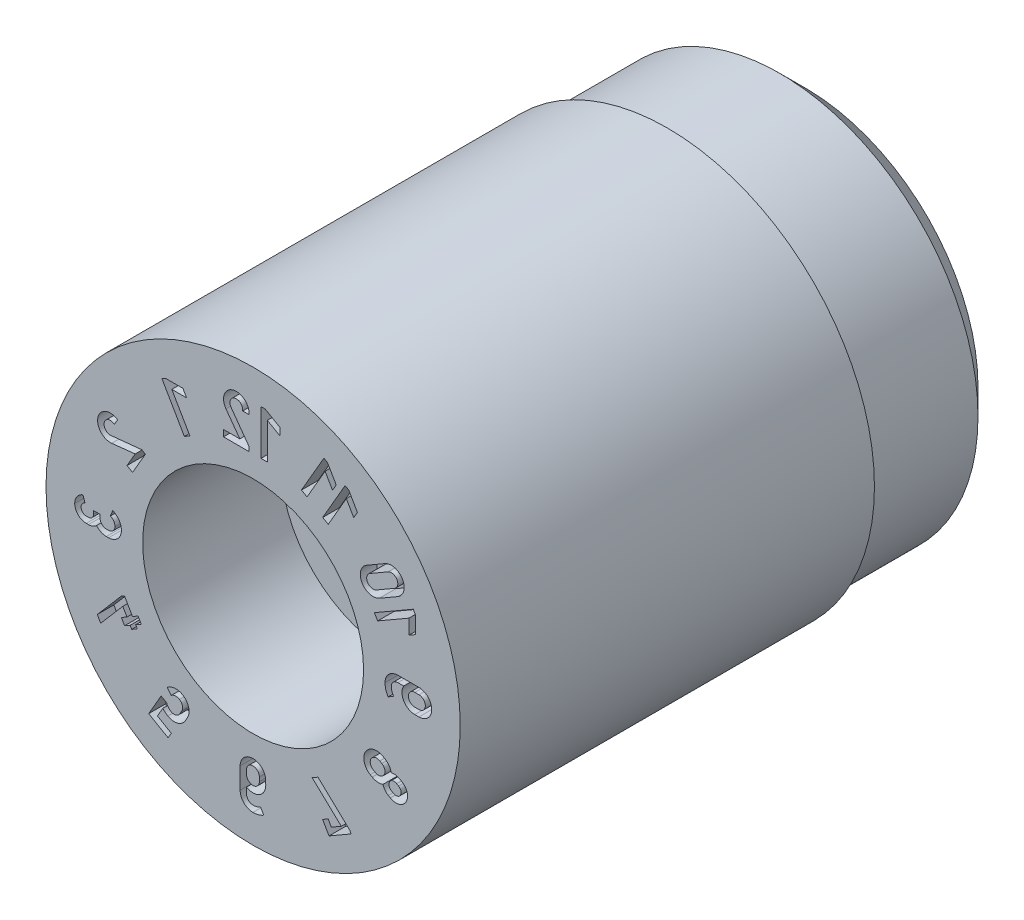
from build123d import *

# Parameters (mm, degrees)
SKETCH5_W          = 1
SKETCH5_H          = 1
CUT_EXTRUDE1_DEPTH = 0.12


with BuildPart() as part:
    # Sketch1 → Revolve1 (revolve)
    with BuildSketch(Plane(origin=(0, 0, 0), x_dir=(0, 0, -1), z_dir=(1, 0, 0)), mode=Mode.PRIVATE) as revolve1_sk:
        Polygon((0, 1.5), (0, 0.8), (1, 0.8), (1, 0.5), (4, 0.5), (4, 1.25), (3.75, 1.5), align=None)
    revolve(revolve1_sk.sketch.rotate(Axis((0, 0, 3.797909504), (0, 0, -1)), 90), axis=Axis((0, 0, 3.797909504), (0, 0, -1)))

    # Sketch5 → Cut-Revolve1 (revolve, cut)
    with BuildSketch(Plane(origin=(0, 0, 0), x_dir=(0, 0, -1), z_dir=(1, 0, 0)), mode=Mode.PRIVATE) as cut_revolve1_sk:
        with Locations((3.5, 1.935)):
            Rectangle(SKETCH5_W, SKETCH5_H)
    revolve(cut_revolve1_sk.sketch.rotate(Axis((0, 0, 0), (0, 0, -1)), 90), axis=Axis((0, 0, 0), (0, 0, -1)), mode=Mode.SUBTRACT)

    # Sketch2 → Cut-Extrude1 (cut)
    # profile 1 of 15: a face of its own
    with BuildSketch(Plane.XY):
        Polygon((0.666279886, 1.08999314), (0.692712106, 1.074732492), (0.755521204, 0.966379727), (0.728784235, 0.920069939), (0.675128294, 1.012599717), (0.544150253, 0.785739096), (0.504001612, 0.808918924), align=None)
    # profile 2 of 15: a face of its own
    with BuildSketch(Plane.XY):
        Polygon((0.512615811, 1.185026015), (0.53904803, 1.169765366), (0.601857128, 1.061412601), (0.575120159, 1.015102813), (0.521464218, 1.107632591), (0.390486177, 0.88077197), (0.350337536, 0.903951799), align=None)
    # profile 3 of 15: a face of its own
    with BuildSketch(Plane.XY):
        with BuildLine():
            Line((1.20106956, 0.091499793), (1.048063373, 0.091473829))
            ThreePointArc((1.048063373, 0.091473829), (0.982498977, 0.064312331), (0.955328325, -0.001248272))
            ThreePointArc((0.955328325, -0.001248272), (0.960888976, -0.042153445), (0.977190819, -0.080079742))
            Line((0.977190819, -0.080079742), (1.017003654, -0.056153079))
            ThreePointArc((1.017003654, -0.056153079), (1.004543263, -0.028190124), (1.001831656, 0.002303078))
            ThreePointArc((1.001831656, 0.002303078), (1.016552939, 0.032767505), (1.048055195, 0.045112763))
            Line((1.048055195, 0.045112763), (1.090613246, 0.045108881))
            ThreePointArc((1.090613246, 0.045108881), (1.090425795, -0.047764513), (1.170932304, -0.094070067))
            Line((1.170932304, -0.094070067), (1.201006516, -0.093966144))
            ThreePointArc((1.201006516, -0.093966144), (1.293771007, -0.001264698), (1.20106956, 0.091499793))
        make_face()
        with BuildLine():
            Line((1.20106956, 0.045114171), (1.17093773, 0.045114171))
            ThreePointArc((1.17093773, 0.045114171), (1.124571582, -0.001253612), (1.170941, -0.047618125))
            Line((1.170941, -0.047618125), (1.201066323, -0.047618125))
            ThreePointArc((1.201066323, -0.047618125), (1.24743409, -0.001253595), (1.20106956, 0.045114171))
        make_face(mode=Mode.SUBTRACT)
    # profile 4 of 15: a face of its own
    with BuildSketch(Plane.XY):
        Polygon((0.427568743, -0.861416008), (0.469482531, -0.837217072), (0.699178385, -1.053673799), (0.710304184, -1.072944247), (0.549687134, -1.165676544), (0.503320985, -1.085368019), (0.543480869, -1.062181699), (0.566660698, -1.102330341), (0.6389305, -1.060605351), align=None)
    # profile 5 of 15: a face of its own
    with BuildSketch(Plane.XY):
        with BuildLine():
            Line((0.95497209, -0.479705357), (0.940930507, -0.471583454))
            ThreePointArc((0.940930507, -0.471583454), (0.814191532, -0.505488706), (0.84819821, -0.632200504))
            Line((0.84819821, -0.632200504), (0.862241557, -0.640308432))
            ThreePointArc((0.862241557, -0.640308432), (0.900654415, -0.652390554), (0.940567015, -0.64705111))
            ThreePointArc((0.940567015, -0.64705111), (0.954999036, -0.675945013), (0.979309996, -0.697208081))
            Line((0.979309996, -0.697208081), (0.993367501, -0.705310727))
            ThreePointArc((0.993367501, -0.705310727), (1.107340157, -0.674766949), (1.076796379, -0.560794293))
            Line((1.076796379, -0.560794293), (1.062773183, -0.55263805))
            ThreePointArc((1.062773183, -0.55263805), (1.032218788, -0.542155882), (0.999978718, -0.54416205))
            ThreePointArc((0.999978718, -0.54416205), (0.984643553, -0.506928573), (0.95497209, -0.479705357))
        make_face()
        with BuildLine():
            Line((1.00248715, -0.657062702), (1.016544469, -0.665163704))
            ThreePointArc((1.016544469, -0.665163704), (1.067210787, -0.651587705), (1.053634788, -0.600921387))
            Line((1.053634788, -0.600921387), (1.039590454, -0.592797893))
            ThreePointArc((1.039590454, -0.592797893), (0.988854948, -0.606348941), (1.00248715, -0.657062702))
        make_face(mode=Mode.SUBTRACT)
        with BuildLine():
            Line((0.871369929, -0.59205045), (0.885434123, -0.600170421))
            ThreePointArc((0.885434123, -0.600170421), (0.948760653, -0.583194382), (0.931784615, -0.519867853))
            Line((0.931784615, -0.519867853), (0.917742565, -0.511730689))
            ThreePointArc((0.917742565, -0.511730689), (0.854413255, -0.528714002), (0.871369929, -0.59205045))
        make_face(mode=Mode.SUBTRACT)
    # profile 6 of 15: a face of its own
    with BuildSketch(Plane.XY):
        Polygon((1.159762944, 0.561328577), (1.175023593, 0.534896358), (1.175241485, 0.409655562), (1.128931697, 0.382918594), (1.128729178, 0.489879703), (0.901868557, 0.358901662), (0.878688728, 0.399050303), align=None)
    # profile 7 of 15: a face of its own
    with BuildSketch(Plane.XY):
        with BuildLine():
            Line((0.955017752, 0.745063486), (0.822511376, 0.668560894))
            ThreePointArc((0.822511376, 0.668560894), (0.788557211, 0.541866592), (0.915253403, 0.507919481))
            Line((0.915253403, 0.507919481), (1.047763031, 0.58442395))
            ThreePointArc((1.047763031, 0.58442395), (1.081710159, 0.711116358), (0.955017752, 0.745063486))
        make_face()
        with BuildLine():
            Line((0.892067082, 0.548079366), (1.024576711, 0.624583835))
            ThreePointArc((1.024576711, 0.624583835), (1.041545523, 0.687912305), (0.978217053, 0.704881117))
            Line((0.978217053, 0.704881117), (0.845691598, 0.628397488))
            ThreePointArc((0.845691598, 0.628397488), (0.828718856, 0.565049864), (0.892067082, 0.548079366))
        make_face(mode=Mode.SUBTRACT)
    # profile 8 of 15: a face of its own
    with BuildSketch(Plane.XY):
        Polygon((0.056903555, 1.280500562), (0.087424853, 1.280500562), (0.19599551, 1.218068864), (0.19599551, 1.164594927), (0.103263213, 1.217900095), (0.103263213, 0.955944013), (0.056903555, 0.955944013), align=None)
    # profile 9 of 15: a face of its own
    with BuildSketch(Plane.XY):
        with BuildLine():
            Line((-0.214176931, 0.955232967), (-0.028712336, 0.955232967))
            Line((-0.028712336, 0.955232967), (-0.028712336, 0.98589707))
            Line((-0.028712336, 0.98589707), (-0.159093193, 1.166908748))
            ThreePointArc((-0.159093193, 1.166908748), (-0.132339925, 1.239101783), (-0.075604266, 1.187057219))
            Line((-0.075604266, 1.187057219), (-0.02896987, 1.187056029))
            ThreePointArc((-0.02896987, 1.187056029), (-0.146647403, 1.283257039), (-0.196777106, 1.139766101))
            Line((-0.196777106, 1.139766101), (-0.095934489, 1.001605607))
            Line((-0.095934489, 1.001605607), (-0.214176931, 1.001605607))
            Line((-0.214176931, 1.001605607), (-0.214176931, 0.955232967))
        make_face()
    # profile 10 of 15: a face of its own
    with BuildSketch(Plane.XY):
        Polygon((-0.660184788, 1.097113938), (-0.633752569, 1.112374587), (-0.508511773, 1.112592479), (-0.481774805, 1.066282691), (-0.588735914, 1.066080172), (-0.457757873, 0.839219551), (-0.497906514, 0.816039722), align=None)
    # profile 11 of 15: a face of its own
    with BuildSketch(Plane.XY):
        with BuildLine():
            Line((0.091451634, -1.048158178), (0.091555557, -1.07823239))
            ThreePointArc((0.091555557, -1.07823239), (0.045250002, -1.158738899), (-0.047623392, -1.158551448))
            Line((-0.047623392, -1.158551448), (-0.047627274, -1.201109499))
            ThreePointArc((-0.047627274, -1.201109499), (-0.035282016, -1.232611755), (-0.004817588, -1.247333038))
            ThreePointArc((-0.004817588, -1.247333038), (0.025673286, -1.24462187), (0.053634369, -1.23216307))
            Line((0.053634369, -1.23216307), (0.077566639, -1.271979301))
            ThreePointArc((0.077566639, -1.271979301), (0.039640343, -1.288281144), (-0.001264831, -1.293841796))
            ThreePointArc((-0.001264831, -1.293841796), (-0.066825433, -1.266671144), (-0.093986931, -1.201106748))
            Line((-0.093986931, -1.201106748), (-0.094012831, -1.048094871))
            ThreePointArc((-0.094012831, -1.048094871), (-0.001248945, -0.955394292), (0.091451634, -1.048158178))
        make_face()
        with BuildLine():
            Line((-0.047627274, -1.04810056), (-0.047627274, -1.07823239))
            ThreePointArc((-0.047627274, -1.07823239), (-0.001259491, -1.124598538), (0.045105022, -1.07822912))
            Line((0.045105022, -1.07822912), (0.045105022, -1.048103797))
            ThreePointArc((0.045105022, -1.048103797), (-0.001259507, -1.001736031), (-0.047627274, -1.04810056))
        make_face(mode=Mode.SUBTRACT)
    # profile 12 of 15: a face of its own
    with BuildSketch(Plane.XY):
        with BuildLine():
            Line((-0.476234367, -0.937748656), (-0.491329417, -0.963816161))
            ThreePointArc((-0.491329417, -0.963816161), (-0.547635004, -1.006972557), (-0.617979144, -0.997780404))
            ThreePointArc((-0.617979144, -0.997780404), (-0.637272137, -0.983842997), (-0.653280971, -0.966230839))
            Line((-0.653280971, -0.966230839), (-0.692895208, -1.034832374))
            Line((-0.692895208, -1.034832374), (-0.592506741, -1.092791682))
            Line((-0.592506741, -1.092791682), (-0.615693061, -1.132951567))
            Line((-0.615693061, -1.132951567), (-0.756230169, -1.051812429))
            Line((-0.756230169, -1.051812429), (-0.666237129, -0.895939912))
            Line((-0.666237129, -0.895939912), (-0.626088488, -0.919119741))
            ThreePointArc((-0.626088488, -0.919119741), (-0.613987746, -0.941262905), (-0.59478806, -0.957637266))
            ThreePointArc((-0.59478806, -0.957637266), (-0.559606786, -0.962271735), (-0.531461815, -0.940660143))
            Line((-0.531461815, -0.940660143), (-0.516382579, -0.914568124))
            ThreePointArc((-0.516382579, -0.914568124), (-0.511743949, -0.879382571), (-0.53335815, -0.85123357))
            ThreePointArc((-0.53335815, -0.85123357), (-0.563954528, -0.844246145), (-0.593186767, -0.855667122))
            Line((-0.593186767, -0.855667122), (-0.622053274, -0.819333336))
            ThreePointArc((-0.622053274, -0.819333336), (-0.567388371, -0.797959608), (-0.510176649, -0.811070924))
            ThreePointArc((-0.510176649, -0.811070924), (-0.466994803, -0.867386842), (-0.476234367, -0.937748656))
        make_face()
    # profile 13 of 15: a face of its own
    with BuildSketch(Plane.XY):
        with BuildLine():
            Line((-1.20875726, -0.084476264), (-1.19253588, -0.084476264))
            ThreePointArc((-1.19253588, -0.084476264), (-1.160858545, -0.07822805), (-1.133926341, -0.060419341))
            ThreePointArc((-1.133926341, -0.060419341), (-1.102030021, -0.085006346), (-1.062716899, -0.093745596))
            Line((-1.062716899, -0.093745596), (-1.04648272, -0.093745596))
            ThreePointArc((-1.04648272, -0.093745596), (-0.980917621, -0.066584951), (-0.953766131, -0.001016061))
            ThreePointArc((-0.953766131, -0.001016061), (-0.971041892, 0.055066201), (-1.016870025, 0.091719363))
            Line((-1.016870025, 0.091719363), (-1.03388221, 0.048600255))
            ThreePointArc((-1.03388221, 0.048600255), (-1.009365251, 0.02899388), (-1.000125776, -0.001008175))
            ThreePointArc((-1.000125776, -0.001008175), (-1.013705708, -0.033793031), (-1.046490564, -0.047372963))
            Line((-1.046490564, -0.047372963), (-1.0627188, -0.047372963))
            ThreePointArc((-1.0627188, -0.047372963), (-1.095496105, -0.033796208), (-1.109072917, -0.001018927))
            Line((-1.109072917, -0.001018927), (-1.109072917, 0.022160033))
            Line((-1.109072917, 0.022160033), (-1.155445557, 0.022160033))
            Line((-1.155445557, 0.022160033), (-1.155445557, -0.001013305))
            ThreePointArc((-1.155445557, -0.001013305), (-1.166309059, -0.027240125), (-1.19253588, -0.038103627))
            Line((-1.19253588, -0.038103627), (-1.20876187, -0.038103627))
            ThreePointArc((-1.20876187, -0.038103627), (-1.234979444, -0.02723094), (-1.24585401, -0.001014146))
            ThreePointArc((-1.24585401, -0.001014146), (-1.238039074, 0.023321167), (-1.217487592, 0.038517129))
            Line((-1.217487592, 0.038517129), (-1.232326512, 0.082449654))
            ThreePointArc((-1.232326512, 0.082449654), (-1.27569277, 0.05035183), (-1.292221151, -0.001006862))
            ThreePointArc((-1.292221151, -0.001006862), (-1.267780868, -0.060032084), (-1.20875726, -0.084476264))
        make_face()
    # profile 14 of 15: a face of its own
    with BuildSketch(Plane.XY):
        Polygon((-1.128545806, -0.616029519), (-1.103989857, -0.658561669), (-0.943793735, -0.472380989), (-0.913759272, -0.524402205), (-0.953907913, -0.547582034), (-0.930728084, -0.587730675), (-0.890579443, -0.564550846), (-0.878986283, -0.584630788), (-0.838837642, -0.561450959), (-0.850430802, -0.541371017), (-0.810270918, -0.518184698), (-0.833450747, -0.478036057), (-0.873610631, -0.501222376), (-0.931569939, -0.400833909), (-0.955045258, -0.414387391), align=None)
    # profile 15 of 15: a face of its own
    with BuildSketch(Plane.XY):
        with BuildLine():
            Line((-0.913162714, 0.425884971), (-0.87300283, 0.402698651))
            Line((-0.87300283, 0.402698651), (-0.780270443, 0.563315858))
            Line((-0.780270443, 0.563315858), (-0.806825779, 0.578647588))
            Line((-0.806825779, 0.578647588), (-1.02877692, 0.556240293))
            ThreePointArc((-1.02877692, 0.556240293), (-1.07791895, 0.615503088), (-1.004482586, 0.63861409))
            Line((-1.004482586, 0.63861409), (-0.981165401, 0.679002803))
            ThreePointArc((-0.981165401, 0.679002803), (-1.123314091, 0.625191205), (-1.024113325, 0.510034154))
            Line((-1.024113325, 0.510034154), (-0.854041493, 0.528285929))
            Line((-0.854041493, 0.528285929), (-0.913162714, 0.425884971))
        make_face()
    extrude(amount=-CUT_EXTRUDE1_DEPTH, mode=Mode.SUBTRACT)


solid = part.part
